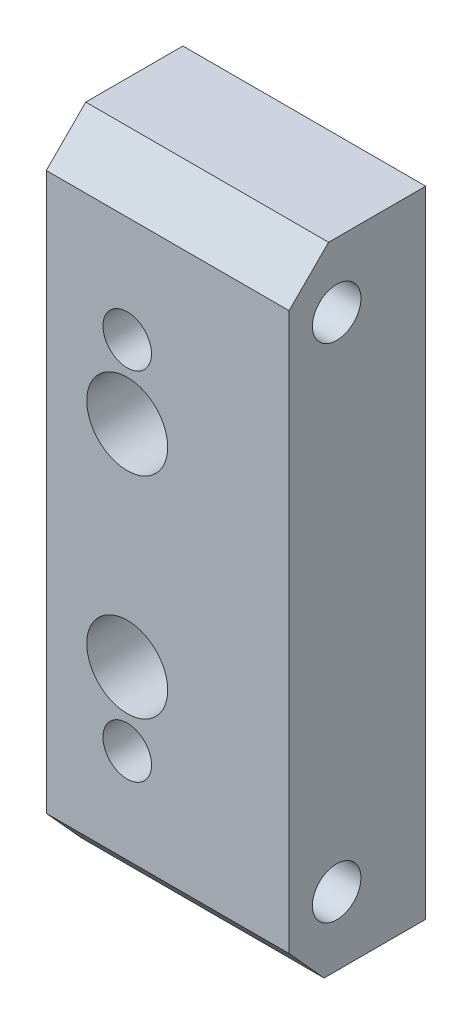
ISO-10303-21;
HEADER;
FILE_DESCRIPTION(('STEP AP214'),'2;1');
FILE_NAME('part.step','',(''),(''),'','','');
FILE_SCHEMA(('AUTOMOTIVE_DESIGN { 1 0 10303 214 1 1 1 1 }'));
ENDSEC;
DATA;
#1=APPLICATION_CONTEXT('core data for automotive mechanical design processes');
#2=APPLICATION_PROTOCOL_DEFINITION('international standard','automotive_design',2000,#1);
#3=PRODUCT_CONTEXT('',#1,'mechanical');
#4=PRODUCT('Part','Part','',(#3));
#5=PRODUCT_RELATED_PRODUCT_CATEGORY('part','',(#4));
#6=PRODUCT_DEFINITION_FORMATION('','',#4);
#7=PRODUCT_DEFINITION_CONTEXT('part definition',#1,'design');
#8=PRODUCT_DEFINITION('design','',#6,#7);
#9=PRODUCT_DEFINITION_SHAPE('','',#8);
#10=(LENGTH_UNIT() NAMED_UNIT(*) SI_UNIT(.MILLI.,.METRE.));
#11=(NAMED_UNIT(*) PLANE_ANGLE_UNIT() SI_UNIT($,.RADIAN.));
#12=(NAMED_UNIT(*) SI_UNIT($,.STERADIAN.) SOLID_ANGLE_UNIT());
#13=UNCERTAINTY_MEASURE_WITH_UNIT(LENGTH_MEASURE(1.E-05),#10,'distance_accuracy_value','');
#14=(GEOMETRIC_REPRESENTATION_CONTEXT(3) GLOBAL_UNCERTAINTY_ASSIGNED_CONTEXT((#13)) GLOBAL_UNIT_ASSIGNED_CONTEXT((#10,
#11,#12)) REPRESENTATION_CONTEXT('',''));
#15=CARTESIAN_POINT('',(0.,0.,0.));
#16=DIRECTION('',(0.,0.,1.));
#17=DIRECTION('',(1.,0.,0.));
#18=AXIS2_PLACEMENT_3D('',#15,#16,#17);
#19=CARTESIAN_POINT('',(-46.9,16.5,-12.));
#20=DIRECTION('',(0.,0.707106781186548,0.707106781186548));
#21=DIRECTION('',(0.,-0.707106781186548,0.707106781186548));
#22=AXIS2_PLACEMENT_3D('',#19,#20,#21);
#23=PLANE('',#22);
#24=DIRECTION('',(0.,-0.70710678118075,0.707106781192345));
#25=VECTOR('',#24,1.);
#26=CARTESIAN_POINT('',(-43.9,19.5,-15.));
#27=LINE('',#26,#25);
#28=CARTESIAN_POINT('',(-43.9,19.5,-15.));
#29=VERTEX_POINT('',#28);
#30=CARTESIAN_POINT('',(-43.9,17.06050014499,-12.56050014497));
#31=VERTEX_POINT('',#30);
#32=EDGE_CURVE('E85',#29,#31,#27,.T.);
#33=ORIENTED_EDGE('',*,*,#32,.T.);
#34=DIRECTION('',(1.,0.,0.));
#35=VECTOR('',#34,1.);
#36=CARTESIAN_POINT('',(-43.9,17.060500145,-12.56050014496));
#37=LINE('',#36,#35);
#38=CARTESIAN_POINT('',(-28.9,17.06050014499,-12.56050014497));
#39=VERTEX_POINT('',#38);
#40=EDGE_CURVE('E81',#39,#31,#37,.F.);
#41=ORIENTED_EDGE('',*,*,#40,.F.);
#42=DIRECTION('',(0.,-0.70710678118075,0.707106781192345));
#43=VECTOR('',#42,1.);
#44=CARTESIAN_POINT('',(-28.9,19.5,-15.));
#45=LINE('',#44,#43);
#46=CARTESIAN_POINT('',(-28.9,19.5,-15.));
#47=VERTEX_POINT('',#46);
#48=EDGE_CURVE('E72',#47,#39,#45,.T.);
#49=ORIENTED_EDGE('',*,*,#48,.F.);
#50=DIRECTION('',(1.,0.,0.));
#51=VECTOR('',#50,1.);
#52=CARTESIAN_POINT('',(-43.9,19.5,-15.));
#53=LINE('',#52,#51);
#54=EDGE_CURVE('E128',#29,#47,#53,.T.);
#55=ORIENTED_EDGE('',*,*,#54,.F.);
#56=EDGE_LOOP('',(#33,#41,#49,#55));
#57=FACE_BOUND('',#56,.T.);
#58=ADVANCED_FACE('F17',(#57),#23,.T.);
#59=CARTESIAN_POINT('',(-36.15,15.5,-15.5));
#60=DIRECTION('',(-1.,0.,0.));
#61=DIRECTION('',(0.,0.,1.));
#62=AXIS2_PLACEMENT_3D('',#59,#60,#61);
#63=CYLINDRICAL_SURFACE('',#62,1.5);
#64=CARTESIAN_POINT('',(-43.9,15.5,-15.5));
#65=DIRECTION('',(-1.,0.,0.));
#66=DIRECTION('',(0.,0.,1.));
#67=AXIS2_PLACEMENT_3D('',#64,#65,#66);
#68=CIRCLE('',#67,1.5);
#69=CARTESIAN_POINT('',(-43.9,15.5,-14.));
#70=VERTEX_POINT('',#69);
#71=EDGE_CURVE('E121',#70,#70,#68,.T.);
#72=ORIENTED_EDGE('',*,*,#71,.T.);
#73=EDGE_LOOP('',(#72));
#74=FACE_BOUND('',#73,.T.);
#75=CARTESIAN_POINT('',(-28.9,15.5,-15.5));
#76=DIRECTION('',(-1.,0.,0.));
#77=DIRECTION('',(0.,0.,1.));
#78=AXIS2_PLACEMENT_3D('',#75,#76,#77);
#79=CIRCLE('',#78,1.5);
#80=CARTESIAN_POINT('',(-28.9,15.5,-14.));
#81=VERTEX_POINT('',#80);
#82=EDGE_CURVE('E20',#81,#81,#79,.T.);
#83=ORIENTED_EDGE('',*,*,#82,.F.);
#84=EDGE_LOOP('',(#83));
#85=FACE_BOUND('',#84,.T.);
#86=ADVANCED_FACE('F133',(#74,#85),#63,.F.);
#87=CARTESIAN_POINT('',(-36.15,-15.5,-15.5));
#88=DIRECTION('',(-1.,0.,0.));
#89=DIRECTION('',(0.,0.,1.));
#90=AXIS2_PLACEMENT_3D('',#87,#88,#89);
#91=CYLINDRICAL_SURFACE('',#90,1.5);
#92=CARTESIAN_POINT('',(-43.9,-15.5,-15.5));
#93=DIRECTION('',(-1.,0.,0.));
#94=DIRECTION('',(0.,0.,1.));
#95=AXIS2_PLACEMENT_3D('',#92,#93,#94);
#96=CIRCLE('',#95,1.5);
#97=CARTESIAN_POINT('',(-43.9,-15.5,-14.));
#98=VERTEX_POINT('',#97);
#99=EDGE_CURVE('E117',#98,#98,#96,.T.);
#100=ORIENTED_EDGE('',*,*,#99,.T.);
#101=EDGE_LOOP('',(#100));
#102=FACE_BOUND('',#101,.T.);
#103=CARTESIAN_POINT('',(-28.9,-15.5,-15.5));
#104=DIRECTION('',(-1.,0.,0.));
#105=DIRECTION('',(0.,0.,1.));
#106=AXIS2_PLACEMENT_3D('',#103,#104,#105);
#107=CIRCLE('',#106,1.5);
#108=CARTESIAN_POINT('',(-28.9,-15.5,-14.));
#109=VERTEX_POINT('',#108);
#110=EDGE_CURVE('E124',#109,#109,#107,.T.);
#111=ORIENTED_EDGE('',*,*,#110,.F.);
#112=EDGE_LOOP('',(#111));
#113=FACE_BOUND('',#112,.T.);
#114=ADVANCED_FACE('F135',(#102,#113),#91,.F.);
#115=CARTESIAN_POINT('',(-43.9,-17.3367900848,-12.56050014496));
#116=DIRECTION('',(0.,-0.671278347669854,0.741205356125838));
#117=DIRECTION('',(0.,-0.741205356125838,-0.671278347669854));
#118=AXIS2_PLACEMENT_3D('',#115,#116,#117);
#119=PLANE('',#118);
#120=DIRECTION('',(0.,-0.741205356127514,-0.671278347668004));
#121=VECTOR('',#120,1.);
#122=CARTESIAN_POINT('',(-43.9,-17.3367900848,-12.56050014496));
#123=LINE('',#122,#121);
#124=CARTESIAN_POINT('',(-43.9,-17.3367900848,-12.56050014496));
#125=VERTEX_POINT('',#124);
#126=CARTESIAN_POINT('',(-43.9,-19.7240104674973,-14.722504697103));
#127=VERTEX_POINT('',#126);
#128=EDGE_CURVE('E123',#125,#127,#123,.T.);
#129=ORIENTED_EDGE('',*,*,#128,.T.);
#130=DIRECTION('',(1.,0.,0.));
#131=VECTOR('',#130,1.);
#132=CARTESIAN_POINT('',(-43.9,-19.7240104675,-14.7225046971));
#133=LINE('',#132,#131);
#134=CARTESIAN_POINT('',(-28.9,-19.7240104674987,-14.7225046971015));
#135=VERTEX_POINT('',#134);
#136=EDGE_CURVE('E193',#135,#127,#133,.F.);
#137=ORIENTED_EDGE('',*,*,#136,.F.);
#138=DIRECTION('',(0.,-0.741205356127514,-0.671278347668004));
#139=VECTOR('',#138,1.);
#140=CARTESIAN_POINT('',(-28.9,-17.3367900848,-12.56050014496));
#141=LINE('',#140,#139);
#142=CARTESIAN_POINT('',(-28.9,-17.3367900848,-12.56050014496));
#143=VERTEX_POINT('',#142);
#144=EDGE_CURVE('E89',#143,#135,#141,.T.);
#145=ORIENTED_EDGE('',*,*,#144,.F.);
#146=DIRECTION('',(1.,0.,0.));
#147=VECTOR('',#146,1.);
#148=CARTESIAN_POINT('',(-43.9,-17.3367900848,-12.56050014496));
#149=LINE('',#148,#147);
#150=EDGE_CURVE('E67',#125,#143,#149,.T.);
#151=ORIENTED_EDGE('',*,*,#150,.F.);
#152=EDGE_LOOP('',(#129,#137,#145,#151));
#153=FACE_BOUND('',#152,.T.);
#154=ADVANCED_FACE('F142',(#153),#119,.T.);
#155=CARTESIAN_POINT('',(-43.9,17.8580973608,-12.56050014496));
#156=DIRECTION('',(0.,0.,1.));
#157=DIRECTION('',(1.,0.,0.));
#158=AXIS2_PLACEMENT_3D('',#155,#156,#157);
#159=PLANE('',#158);
#160=CARTESIAN_POINT('',(-38.9,6.,-12.56050014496));
#161=DIRECTION('',(0.,0.,1.));
#162=DIRECTION('',(1.,0.,0.));
#163=AXIS2_PLACEMENT_3D('',#160,#161,#162);
#164=CIRCLE('',#163,2.5);
#165=CARTESIAN_POINT('',(-36.4,6.,-12.56050014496));
#166=VERTEX_POINT('',#165);
#167=EDGE_CURVE('E114',#166,#166,#164,.F.);
#168=ORIENTED_EDGE('',*,*,#167,.T.);
#169=EDGE_LOOP('',(#168));
#170=FACE_BOUND('',#169,.T.);
#171=CARTESIAN_POINT('',(-38.9,-11.5,-12.56050014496));
#172=DIRECTION('',(0.,0.,1.));
#173=DIRECTION('',(1.,0.,0.));
#174=AXIS2_PLACEMENT_3D('',#171,#172,#173);
#175=CIRCLE('',#174,1.5);
#176=CARTESIAN_POINT('',(-37.4,-11.5,-12.56050014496));
#177=VERTEX_POINT('',#176);
#178=EDGE_CURVE('E104',#177,#177,#175,.F.);
#179=ORIENTED_EDGE('',*,*,#178,.T.);
#180=EDGE_LOOP('',(#179));
#181=FACE_BOUND('',#180,.T.);
#182=CARTESIAN_POINT('',(-38.9,-7.,-12.56050014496));
#183=DIRECTION('',(0.,0.,1.));
#184=DIRECTION('',(1.,0.,0.));
#185=AXIS2_PLACEMENT_3D('',#182,#183,#184);
#186=CIRCLE('',#185,2.5);
#187=CARTESIAN_POINT('',(-36.4,-7.,-12.56050014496));
#188=VERTEX_POINT('',#187);
#189=EDGE_CURVE('E111',#188,#188,#186,.F.);
#190=ORIENTED_EDGE('',*,*,#189,.T.);
#191=EDGE_LOOP('',(#190));
#192=FACE_BOUND('',#191,.T.);
#193=CARTESIAN_POINT('',(-38.9,10.5,-12.56050014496));
#194=DIRECTION('',(0.,0.,1.));
#195=DIRECTION('',(1.,0.,0.));
#196=AXIS2_PLACEMENT_3D('',#193,#194,#195);
#197=CIRCLE('',#196,1.5);
#198=CARTESIAN_POINT('',(-37.4,10.5,-12.56050014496));
#199=VERTEX_POINT('',#198);
#200=EDGE_CURVE('E108',#199,#199,#197,.F.);
#201=ORIENTED_EDGE('',*,*,#200,.T.);
#202=EDGE_LOOP('',(#201));
#203=FACE_BOUND('',#202,.T.);
#204=DIRECTION('',(0.,1.,0.));
#205=VECTOR('',#204,1.);
#206=CARTESIAN_POINT('',(-28.9,-0.5,-12.56050014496));
#207=LINE('',#206,#205);
#208=EDGE_CURVE('E75',#39,#143,#207,.F.);
#209=ORIENTED_EDGE('',*,*,#208,.F.);
#210=ORIENTED_EDGE('',*,*,#40,.T.);
#211=DIRECTION('',(0.,1.,0.));
#212=VECTOR('',#211,1.);
#213=CARTESIAN_POINT('',(-43.9,-0.5,-12.56050014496));
#214=LINE('',#213,#212);
#215=EDGE_CURVE('E195',#31,#125,#214,.F.);
#216=ORIENTED_EDGE('',*,*,#215,.T.);
#217=ORIENTED_EDGE('',*,*,#150,.T.);
#218=EDGE_LOOP('',(#209,#210,#216,#217));
#219=FACE_BOUND('',#218,.T.);
#220=ADVANCED_FACE('F88',(#170,#181,#192,#203,#219),#159,.T.);
#221=CARTESIAN_POINT('',(-28.9,-0.5,-21.));
#222=DIRECTION('',(1.,0.,0.));
#223=DIRECTION('',(0.,0.,-1.));
#224=AXIS2_PLACEMENT_3D('',#221,#222,#223);
#225=PLANE('',#224);
#226=ORIENTED_EDGE('',*,*,#110,.T.);
#227=EDGE_LOOP('',(#226));
#228=FACE_BOUND('',#227,.T.);
#229=ORIENTED_EDGE('',*,*,#82,.T.);
#230=EDGE_LOOP('',(#229));
#231=FACE_BOUND('',#230,.T.);
#232=ORIENTED_EDGE('',*,*,#144,.T.);
#233=DIRECTION('',(0.,0.,-1.));
#234=VECTOR('',#233,1.);
#235=CARTESIAN_POINT('',(-28.9,-19.7240104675,-14.22220516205));
#236=LINE('',#235,#234);
#237=CARTESIAN_POINT('',(-28.9,-19.7240104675,-21.));
#238=VERTEX_POINT('',#237);
#239=EDGE_CURVE('E120',#238,#135,#236,.F.);
#240=ORIENTED_EDGE('',*,*,#239,.F.);
#241=DIRECTION('',(0.,1.,0.));
#242=VECTOR('',#241,1.);
#243=CARTESIAN_POINT('',(-28.9,19.5,-21.));
#244=LINE('',#243,#242);
#245=CARTESIAN_POINT('',(-28.9,19.5,-21.));
#246=VERTEX_POINT('',#245);
#247=EDGE_CURVE('E107',#238,#246,#244,.T.);
#248=ORIENTED_EDGE('',*,*,#247,.T.);
#249=DIRECTION('',(0.,0.,1.));
#250=VECTOR('',#249,1.);
#251=CARTESIAN_POINT('',(-28.9,19.5,-21.));
#252=LINE('',#251,#250);
#253=EDGE_CURVE('E78',#47,#246,#252,.F.);
#254=ORIENTED_EDGE('',*,*,#253,.F.);
#255=ORIENTED_EDGE('',*,*,#48,.T.);
#256=ORIENTED_EDGE('',*,*,#208,.T.);
#257=EDGE_LOOP('',(#232,#240,#248,#254,#255,#256));
#258=FACE_BOUND('',#257,.T.);
#259=ADVANCED_FACE('F74',(#228,#231,#258),#225,.T.);
#260=CARTESIAN_POINT('',(-43.9,19.5,-21.));
#261=DIRECTION('',(0.,1.,0.));
#262=DIRECTION('',(0.,0.,1.));
#263=AXIS2_PLACEMENT_3D('',#260,#261,#262);
#264=PLANE('',#263);
#265=DIRECTION('',(0.,0.,-1.));
#266=VECTOR('',#265,1.);
#267=CARTESIAN_POINT('',(-43.9,19.5,-21.));
#268=LINE('',#267,#266);
#269=CARTESIAN_POINT('',(-43.9,19.5,-21.));
#270=VERTEX_POINT('',#269);
#271=EDGE_CURVE('E209',#270,#29,#268,.F.);
#272=ORIENTED_EDGE('',*,*,#271,.T.);
#273=ORIENTED_EDGE('',*,*,#54,.T.);
#274=ORIENTED_EDGE('',*,*,#253,.T.);
#275=DIRECTION('',(1.,0.,0.));
#276=VECTOR('',#275,1.);
#277=CARTESIAN_POINT('',(-43.9,19.5,-21.));
#278=LINE('',#277,#276);
#279=EDGE_CURVE('E215',#246,#270,#278,.F.);
#280=ORIENTED_EDGE('',*,*,#279,.T.);
#281=EDGE_LOOP('',(#272,#273,#274,#280));
#282=FACE_BOUND('',#281,.T.);
#283=ADVANCED_FACE('F176',(#282),#264,.T.);
#284=CARTESIAN_POINT('',(-43.9,-0.5,-21.));
#285=DIRECTION('',(1.,0.,0.));
#286=DIRECTION('',(0.,0.,-1.));
#287=AXIS2_PLACEMENT_3D('',#284,#285,#286);
#288=PLANE('',#287);
#289=ORIENTED_EDGE('',*,*,#99,.F.);
#290=EDGE_LOOP('',(#289));
#291=FACE_BOUND('',#290,.T.);
#292=ORIENTED_EDGE('',*,*,#71,.F.);
#293=EDGE_LOOP('',(#292));
#294=FACE_BOUND('',#293,.T.);
#295=ORIENTED_EDGE('',*,*,#128,.F.);
#296=ORIENTED_EDGE('',*,*,#215,.F.);
#297=ORIENTED_EDGE('',*,*,#32,.F.);
#298=ORIENTED_EDGE('',*,*,#271,.F.);
#299=DIRECTION('',(0.,1.,0.));
#300=VECTOR('',#299,1.);
#301=CARTESIAN_POINT('',(-43.9,19.5,-21.));
#302=LINE('',#301,#300);
#303=CARTESIAN_POINT('',(-43.9,-19.7240104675,-21.));
#304=VERTEX_POINT('',#303);
#305=EDGE_CURVE('E199',#270,#304,#302,.F.);
#306=ORIENTED_EDGE('',*,*,#305,.T.);
#307=DIRECTION('',(0.,0.,-1.));
#308=VECTOR('',#307,1.);
#309=CARTESIAN_POINT('',(-43.9,-19.7240104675,-14.22220516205));
#310=LINE('',#309,#308);
#311=EDGE_CURVE('E35',#127,#304,#310,.T.);
#312=ORIENTED_EDGE('',*,*,#311,.F.);
#313=EDGE_LOOP('',(#295,#296,#297,#298,#306,#312));
#314=FACE_BOUND('',#313,.T.);
#315=ADVANCED_FACE('F173',(#291,#294,#314),#288,.F.);
#316=CARTESIAN_POINT('',(-43.9,-19.7240104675,-14.22220516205));
#317=DIRECTION('',(0.,-1.,0.));
#318=DIRECTION('',(0.,0.,-1.));
#319=AXIS2_PLACEMENT_3D('',#316,#317,#318);
#320=PLANE('',#319);
#321=ORIENTED_EDGE('',*,*,#136,.T.);
#322=ORIENTED_EDGE('',*,*,#311,.T.);
#323=DIRECTION('',(1.,0.,0.));
#324=VECTOR('',#323,1.);
#325=CARTESIAN_POINT('',(-43.9,-19.7240104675,-21.));
#326=LINE('',#325,#324);
#327=EDGE_CURVE('E103',#304,#238,#326,.T.);
#328=ORIENTED_EDGE('',*,*,#327,.T.);
#329=ORIENTED_EDGE('',*,*,#239,.T.);
#330=EDGE_LOOP('',(#321,#322,#328,#329));
#331=FACE_BOUND('',#330,.T.);
#332=ADVANCED_FACE('F169',(#331),#320,.T.);
#333=CARTESIAN_POINT('',(-38.9,6.,-19.75));
#334=DIRECTION('',(0.,0.,1.));
#335=DIRECTION('',(1.,0.,0.));
#336=AXIS2_PLACEMENT_3D('',#333,#334,#335);
#337=CYLINDRICAL_SURFACE('',#336,2.5);
#338=CARTESIAN_POINT('',(-38.9,6.,-21.));
#339=DIRECTION('',(0.,0.,1.));
#340=DIRECTION('',(1.,0.,0.));
#341=AXIS2_PLACEMENT_3D('',#338,#339,#340);
#342=CIRCLE('',#341,2.5);
#343=CARTESIAN_POINT('',(-36.4,6.,-21.));
#344=VERTEX_POINT('',#343);
#345=EDGE_CURVE('E100',#344,#344,#342,.F.);
#346=ORIENTED_EDGE('',*,*,#345,.T.);
#347=EDGE_LOOP('',(#346));
#348=FACE_BOUND('',#347,.T.);
#349=ORIENTED_EDGE('',*,*,#167,.F.);
#350=EDGE_LOOP('',(#349));
#351=FACE_BOUND('',#350,.T.);
#352=ADVANCED_FACE('F165',(#348,#351),#337,.F.);
#353=CARTESIAN_POINT('',(-38.9,-7.,-19.75));
#354=DIRECTION('',(0.,0.,1.));
#355=DIRECTION('',(1.,0.,0.));
#356=AXIS2_PLACEMENT_3D('',#353,#354,#355);
#357=CYLINDRICAL_SURFACE('',#356,2.5);
#358=CARTESIAN_POINT('',(-38.9,-7.,-21.));
#359=DIRECTION('',(0.,0.,1.));
#360=DIRECTION('',(1.,0.,0.));
#361=AXIS2_PLACEMENT_3D('',#358,#359,#360);
#362=CIRCLE('',#361,2.5);
#363=CARTESIAN_POINT('',(-36.4,-7.,-21.));
#364=VERTEX_POINT('',#363);
#365=EDGE_CURVE('E97',#364,#364,#362,.F.);
#366=ORIENTED_EDGE('',*,*,#365,.T.);
#367=EDGE_LOOP('',(#366));
#368=FACE_BOUND('',#367,.T.);
#369=ORIENTED_EDGE('',*,*,#189,.F.);
#370=EDGE_LOOP('',(#369));
#371=FACE_BOUND('',#370,.T.);
#372=ADVANCED_FACE('F161',(#368,#371),#357,.F.);
#373=CARTESIAN_POINT('',(-38.9,10.5,-19.75));
#374=DIRECTION('',(0.,0.,1.));
#375=DIRECTION('',(1.,0.,0.));
#376=AXIS2_PLACEMENT_3D('',#373,#374,#375);
#377=CYLINDRICAL_SURFACE('',#376,1.5);
#378=CARTESIAN_POINT('',(-38.9,10.5,-21.));
#379=DIRECTION('',(0.,0.,1.));
#380=DIRECTION('',(1.,0.,0.));
#381=AXIS2_PLACEMENT_3D('',#378,#379,#380);
#382=CIRCLE('',#381,1.5);
#383=CARTESIAN_POINT('',(-37.4,10.5,-21.));
#384=VERTEX_POINT('',#383);
#385=EDGE_CURVE('E26',#384,#384,#382,.F.);
#386=ORIENTED_EDGE('',*,*,#385,.T.);
#387=EDGE_LOOP('',(#386));
#388=FACE_BOUND('',#387,.T.);
#389=ORIENTED_EDGE('',*,*,#200,.F.);
#390=EDGE_LOOP('',(#389));
#391=FACE_BOUND('',#390,.T.);
#392=ADVANCED_FACE('F153',(#388,#391),#377,.F.);
#393=CARTESIAN_POINT('',(-38.9,-11.5,-19.75));
#394=DIRECTION('',(0.,0.,1.));
#395=DIRECTION('',(1.,0.,0.));
#396=AXIS2_PLACEMENT_3D('',#393,#394,#395);
#397=CYLINDRICAL_SURFACE('',#396,1.5);
#398=CARTESIAN_POINT('',(-38.9,-11.5,-21.));
#399=DIRECTION('',(0.,0.,1.));
#400=DIRECTION('',(1.,0.,0.));
#401=AXIS2_PLACEMENT_3D('',#398,#399,#400);
#402=CIRCLE('',#401,1.5);
#403=CARTESIAN_POINT('',(-37.4,-11.5,-21.));
#404=VERTEX_POINT('',#403);
#405=EDGE_CURVE('E11',#404,#404,#402,.F.);
#406=ORIENTED_EDGE('',*,*,#405,.T.);
#407=EDGE_LOOP('',(#406));
#408=FACE_BOUND('',#407,.T.);
#409=ORIENTED_EDGE('',*,*,#178,.F.);
#410=EDGE_LOOP('',(#409));
#411=FACE_BOUND('',#410,.T.);
#412=ADVANCED_FACE('F147',(#408,#411),#397,.F.);
#413=CARTESIAN_POINT('',(-43.9,19.5,-21.));
#414=DIRECTION('',(0.,0.,1.));
#415=DIRECTION('',(1.,0.,0.));
#416=AXIS2_PLACEMENT_3D('',#413,#414,#415);
#417=PLANE('',#416);
#418=ORIENTED_EDGE('',*,*,#405,.F.);
#419=EDGE_LOOP('',(#418));
#420=FACE_BOUND('',#419,.T.);
#421=ORIENTED_EDGE('',*,*,#385,.F.);
#422=EDGE_LOOP('',(#421));
#423=FACE_BOUND('',#422,.T.);
#424=ORIENTED_EDGE('',*,*,#365,.F.);
#425=EDGE_LOOP('',(#424));
#426=FACE_BOUND('',#425,.T.);
#427=ORIENTED_EDGE('',*,*,#345,.F.);
#428=EDGE_LOOP('',(#427));
#429=FACE_BOUND('',#428,.T.);
#430=ORIENTED_EDGE('',*,*,#305,.F.);
#431=ORIENTED_EDGE('',*,*,#279,.F.);
#432=ORIENTED_EDGE('',*,*,#247,.F.);
#433=ORIENTED_EDGE('',*,*,#327,.F.);
#434=EDGE_LOOP('',(#430,#431,#432,#433));
#435=FACE_BOUND('',#434,.T.);
#436=ADVANCED_FACE('F145',(#420,#423,#426,#429,#435),#417,.F.);
#437=CLOSED_SHELL('',(#58,#86,#114,#154,#220,#259,#283,#315,#332,#352,#372,#392,#412,#436));
#438=MANIFOLD_SOLID_BREP('B1',#437);
#439=ADVANCED_BREP_SHAPE_REPRESENTATION('',(#18,#438),#14);
#440=SHAPE_DEFINITION_REPRESENTATION(#9,#439);
ENDSEC;
END-ISO-10303-21;
